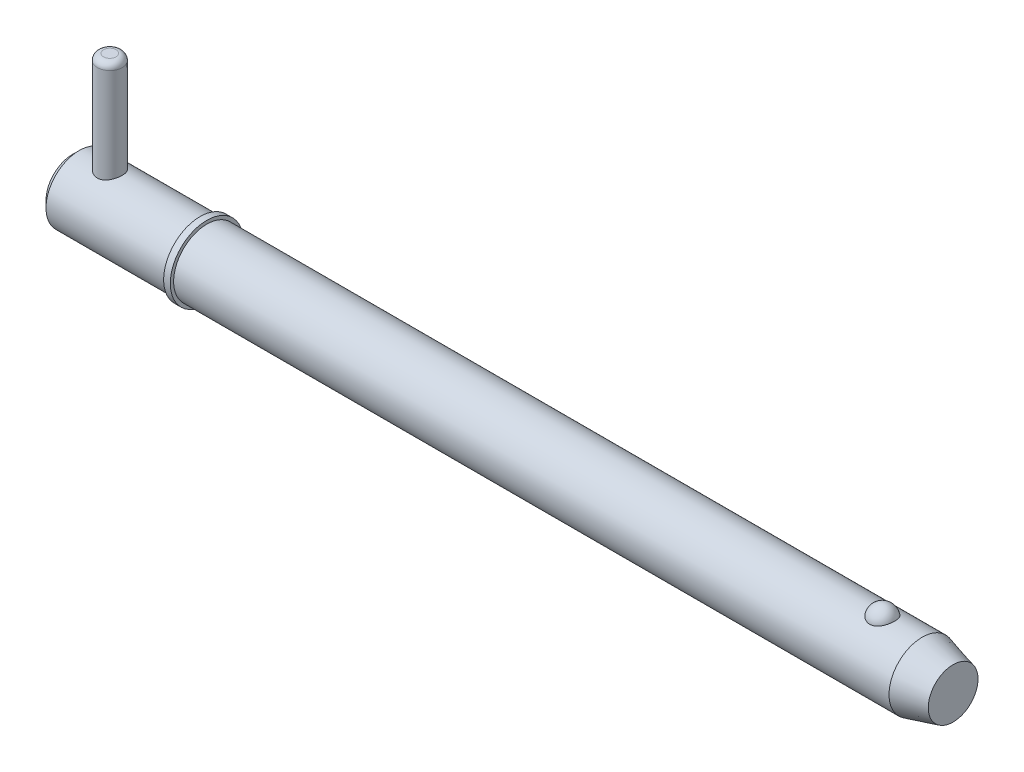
ISO-10303-21;
HEADER;
FILE_DESCRIPTION(('STEP AP214'),'2;1');
FILE_NAME('part.step','',(''),(''),'','','');
FILE_SCHEMA(('AUTOMOTIVE_DESIGN { 1 0 10303 214 1 1 1 1 }'));
ENDSEC;
DATA;
#1=APPLICATION_CONTEXT('core data for automotive mechanical design processes');
#2=APPLICATION_PROTOCOL_DEFINITION('international standard','automotive_design',2000,#1);
#3=PRODUCT_CONTEXT('',#1,'mechanical');
#4=PRODUCT('Part','Part','',(#3));
#5=PRODUCT_RELATED_PRODUCT_CATEGORY('part','',(#4));
#6=PRODUCT_DEFINITION_FORMATION('','',#4);
#7=PRODUCT_DEFINITION_CONTEXT('part definition',#1,'design');
#8=PRODUCT_DEFINITION('design','',#6,#7);
#9=PRODUCT_DEFINITION_SHAPE('','',#8);
#10=(LENGTH_UNIT() NAMED_UNIT(*) SI_UNIT(.MILLI.,.METRE.));
#11=(NAMED_UNIT(*) PLANE_ANGLE_UNIT() SI_UNIT($,.RADIAN.));
#12=(NAMED_UNIT(*) SI_UNIT($,.STERADIAN.) SOLID_ANGLE_UNIT());
#13=UNCERTAINTY_MEASURE_WITH_UNIT(LENGTH_MEASURE(1.E-05),#10,'distance_accuracy_value','');
#14=(GEOMETRIC_REPRESENTATION_CONTEXT(3) GLOBAL_UNCERTAINTY_ASSIGNED_CONTEXT((#13)) GLOBAL_UNIT_ASSIGNED_CONTEXT((#10,
#11,#12)) REPRESENTATION_CONTEXT('',''));
#15=CARTESIAN_POINT('',(0.,0.,0.));
#16=DIRECTION('',(0.,0.,1.));
#17=DIRECTION('',(1.,0.,0.));
#18=AXIS2_PLACEMENT_3D('',#15,#16,#17);
#19=CARTESIAN_POINT('',(7.14,25.4,0.));
#20=DIRECTION('',(0.,-1.,0.));
#21=DIRECTION('',(0.,0.,-1.));
#22=AXIS2_PLACEMENT_3D('',#19,#20,#21);
#23=CYLINDRICAL_SURFACE('',#22,2.38);
#24=CARTESIAN_POINT('',(7.14,-5.16,0.));
#25=DIRECTION('',(0.,1.,0.));
#26=DIRECTION('',(0.,0.,1.));
#27=AXIS2_PLACEMENT_3D('',#24,#25,#26);
#28=CIRCLE('',#27,2.38);
#29=CARTESIAN_POINT('',(7.14,-5.16,2.38));
#30=VERTEX_POINT('',#29);
#31=EDGE_CURVE('P0_E25',#30,#30,#28,.T.);
#32=ORIENTED_EDGE('',*,*,#31,.T.);
#33=EDGE_LOOP('',(#32));
#34=FACE_BOUND('',#33,.T.);
#35=CARTESIAN_POINT('',(7.14,24.21,0.));
#36=DIRECTION('',(0.,1.,0.));
#37=DIRECTION('',(0.,0.,1.));
#38=AXIS2_PLACEMENT_3D('',#35,#36,#37);
#39=CIRCLE('',#38,2.38);
#40=CARTESIAN_POINT('',(7.14,24.21,2.38));
#41=VERTEX_POINT('',#40);
#42=EDGE_CURVE('P0_E29',#41,#41,#39,.F.);
#43=ORIENTED_EDGE('',*,*,#42,.T.);
#44=EDGE_LOOP('',(#43));
#45=FACE_BOUND('',#44,.T.);
#46=ADVANCED_FACE('P0_F14',(#34,#45),#23,.T.);
#47=CARTESIAN_POINT('',(7.14,25.4,0.));
#48=DIRECTION('',(0.,1.,0.));
#49=DIRECTION('',(0.,0.,1.));
#50=AXIS2_PLACEMENT_3D('',#47,#48,#49);
#51=PLANE('',#50);
#52=CARTESIAN_POINT('',(7.14,25.4,0.));
#53=DIRECTION('',(0.,1.,0.));
#54=DIRECTION('',(0.,0.,1.));
#55=AXIS2_PLACEMENT_3D('',#52,#53,#54);
#56=CIRCLE('',#55,1.19);
#57=CARTESIAN_POINT('',(7.14,25.4,1.19));
#58=VERTEX_POINT('',#57);
#59=EDGE_CURVE('P0_E10',#58,#58,#56,.T.);
#60=ORIENTED_EDGE('',*,*,#59,.T.);
#61=EDGE_LOOP('',(#60));
#62=FACE_BOUND('',#61,.T.);
#63=ADVANCED_FACE('P0_F46',(#62),#51,.T.);
#64=CARTESIAN_POINT('',(7.14,-6.35,0.));
#65=DIRECTION('',(0.,1.,0.));
#66=DIRECTION('',(0.,0.,1.));
#67=AXIS2_PLACEMENT_3D('',#64,#65,#66);
#68=PLANE('',#67);
#69=CARTESIAN_POINT('',(7.14,-6.35,0.));
#70=DIRECTION('',(0.,1.,0.));
#71=DIRECTION('',(0.,0.,1.));
#72=AXIS2_PLACEMENT_3D('',#69,#70,#71);
#73=CIRCLE('',#72,1.19);
#74=CARTESIAN_POINT('',(7.14,-6.35,1.19));
#75=VERTEX_POINT('',#74);
#76=EDGE_CURVE('P0_E21',#75,#75,#73,.F.);
#77=ORIENTED_EDGE('',*,*,#76,.T.);
#78=EDGE_LOOP('',(#77));
#79=FACE_BOUND('',#78,.T.);
#80=ADVANCED_FACE('P0_F43',(#79),#68,.F.);
#81=CARTESIAN_POINT('',(7.14,-5.16,0.));
#82=DIRECTION('',(0.,1.,0.));
#83=DIRECTION('',(0.,0.,1.));
#84=AXIS2_PLACEMENT_3D('',#81,#82,#83);
#85=DEGENERATE_TOROIDAL_SURFACE('',#84,1.19,1.19,.T.);
#86=ORIENTED_EDGE('',*,*,#76,.F.);
#87=EDGE_LOOP('',(#86));
#88=FACE_BOUND('',#87,.T.);
#89=ORIENTED_EDGE('',*,*,#31,.F.);
#90=EDGE_LOOP('',(#89));
#91=FACE_BOUND('',#90,.T.);
#92=ADVANCED_FACE('P0_F38',(#88,#91),#85,.T.);
#93=CARTESIAN_POINT('',(7.14,24.21,0.));
#94=DIRECTION('',(0.,1.,0.));
#95=DIRECTION('',(0.,0.,1.));
#96=AXIS2_PLACEMENT_3D('',#93,#94,#95);
#97=DEGENERATE_TOROIDAL_SURFACE('',#96,1.19,1.19,.T.);
#98=ORIENTED_EDGE('',*,*,#42,.F.);
#99=EDGE_LOOP('',(#98));
#100=FACE_BOUND('',#99,.T.);
#101=ORIENTED_EDGE('',*,*,#59,.F.);
#102=EDGE_LOOP('',(#101));
#103=FACE_BOUND('',#102,.T.);
#104=ADVANCED_FACE('P0_F16',(#100,#103),#97,.T.);
#105=CLOSED_SHELL('',(#46,#63,#80,#92,#104));
#106=MANIFOLD_SOLID_BREP('P0_B1',#105);
#107=CARTESIAN_POINT('',(0.,0.,0.));
#108=DIRECTION('',(1.,0.,0.));
#109=DIRECTION('',(0.,0.,-1.));
#110=AXIS2_PLACEMENT_3D('',#107,#108,#109);
#111=CYLINDRICAL_SURFACE('',#110,6.35);
#112=CARTESIAN_POINT('',(162.655369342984,0.,0.));
#113=DIRECTION('',(1.,0.,0.));
#114=DIRECTION('',(0.,0.,-1.));
#115=AXIS2_PLACEMENT_3D('',#112,#113,#114);
#116=CIRCLE('',#115,6.35);
#117=CARTESIAN_POINT('',(162.655369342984,0.,-6.35));
#118=VERTEX_POINT('',#117);
#119=EDGE_CURVE('P1_E81',#118,#118,#116,.T.);
#120=ORIENTED_EDGE('',*,*,#119,.F.);
#121=EDGE_LOOP('',(#120));
#122=FACE_BOUND('',#121,.T.);
#123=CARTESIAN_POINT('',(25.7,0.,0.));
#124=DIRECTION('',(1.,0.,0.));
#125=DIRECTION('',(0.,0.,-1.));
#126=AXIS2_PLACEMENT_3D('',#123,#124,#125);
#127=CIRCLE('',#126,6.35);
#128=CARTESIAN_POINT('',(25.7,0.,-6.35));
#129=VERTEX_POINT('',#128);
#130=EDGE_CURVE('P1_E85',#129,#129,#127,.T.);
#131=ORIENTED_EDGE('',*,*,#130,.T.);
#132=EDGE_LOOP('',(#131));
#133=FACE_BOUND('',#132,.T.);
#134=CARTESIAN_POINT('',(155.030021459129,5.87502187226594,2.40969251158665));
#135=CARTESIAN_POINT('',(154.905030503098,5.87501645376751,2.40969773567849));
#136=CARTESIAN_POINT('',(154.780080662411,5.87916061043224,2.39967292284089));
#137=CARTESIAN_POINT('',(154.533909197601,5.89523112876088,2.35991730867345));
#138=CARTESIAN_POINT('',(154.412686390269,5.90715499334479,2.33019283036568));
#139=CARTESIAN_POINT('',(154.177517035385,5.93739567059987,2.25201402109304));
#140=CARTESIAN_POINT('',(154.063560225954,5.95570321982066,2.20358681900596));
#141=CARTESIAN_POINT('',(153.84557352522,5.99672067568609,2.08937987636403));
#142=CARTESIAN_POINT('',(153.741545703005,6.0194314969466,2.02359652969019));
#143=CARTESIAN_POINT('',(153.542943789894,6.06760647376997,1.87428969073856));
#144=CARTESIAN_POINT('',(153.448726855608,6.09313095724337,1.79031110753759));
#145=CARTESIAN_POINT('',(153.275255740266,6.14375873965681,1.6080017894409));
#146=CARTESIAN_POINT('',(153.196004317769,6.16886196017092,1.50966841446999));
#147=CARTESIAN_POINT('',(153.050845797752,6.21724600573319,1.29645884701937));
#148=CARTESIAN_POINT('',(152.985688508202,6.24039621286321,1.1810415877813));
#149=CARTESIAN_POINT('',(152.874703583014,6.28117277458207,0.940351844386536));
#150=CARTESIAN_POINT('',(152.828877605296,6.29879865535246,0.815078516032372));
#151=CARTESIAN_POINT('',(152.757023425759,6.32692073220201,0.556494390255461));
#152=CARTESIAN_POINT('',(152.731249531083,6.33732517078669,0.423102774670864));
#153=CARTESIAN_POINT('',(152.700988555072,6.34957673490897,0.153542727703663));
#154=CARTESIAN_POINT('',(152.696500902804,6.35142408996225,0.0173743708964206));
#155=CARTESIAN_POINT('',(152.708865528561,6.34638925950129,-0.253036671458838));
#156=CARTESIAN_POINT('',(152.725594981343,6.33955731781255,-0.387285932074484));
#157=CARTESIAN_POINT('',(152.779843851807,6.31794129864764,-0.650851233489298));
#158=CARTESIAN_POINT('',(152.817363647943,6.3031570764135,-0.780167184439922));
#159=CARTESIAN_POINT('',(152.912500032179,6.26711642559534,-1.03041949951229));
#160=CARTESIAN_POINT('',(152.970143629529,6.24585130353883,-1.15134433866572));
#161=CARTESIAN_POINT('',(153.104352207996,6.19905619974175,-1.38129800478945));
#162=CARTESIAN_POINT('',(153.180918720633,6.17352587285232,-1.49032586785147));
#163=CARTESIAN_POINT('',(153.351753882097,6.12080227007,-1.69393164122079));
#164=CARTESIAN_POINT('',(153.446100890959,6.09360200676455,-1.78844209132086));
#165=CARTESIAN_POINT('',(153.650119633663,6.04070434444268,-1.95970536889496));
#166=CARTESIAN_POINT('',(153.759790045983,6.015006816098,-2.0364597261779));
#167=CARTESIAN_POINT('',(153.989187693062,5.96867714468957,-2.16845644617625));
#168=CARTESIAN_POINT('',(154.108652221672,5.94794910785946,-2.22412062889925));
#169=CARTESIAN_POINT('',(154.356218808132,5.91340580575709,-2.31440992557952));
#170=CARTESIAN_POINT('',(154.484317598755,5.89958794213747,-2.34904294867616));
#171=CARTESIAN_POINT('',(154.738582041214,5.88111049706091,-2.39491590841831));
#172=CARTESIAN_POINT('',(154.864520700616,5.87602512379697,-2.40724512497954));
#173=CARTESIAN_POINT('',(155.116786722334,5.87428980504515,-2.41147867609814));
#174=CARTESIAN_POINT('',(155.243114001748,5.8776381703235,-2.40338710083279));
#175=CARTESIAN_POINT('',(155.488417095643,5.89212921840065,-2.36762715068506));
#176=CARTESIAN_POINT('',(155.607499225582,5.90302431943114,-2.3405803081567));
#177=CARTESIAN_POINT('',(155.83924472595,5.93113752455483,-2.26839066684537));
#178=CARTESIAN_POINT('',(155.951907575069,5.94835614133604,-2.22324640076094));
#179=CARTESIAN_POINT('',(156.170400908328,5.9877301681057,-2.11493806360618));
#180=CARTESIAN_POINT('',(156.276028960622,6.00998499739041,-2.05140269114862));
#181=CARTESIAN_POINT('',(156.475300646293,6.05690144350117,-1.90842705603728));
#182=CARTESIAN_POINT('',(156.568941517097,6.08156361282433,-1.82898313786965));
#183=CARTESIAN_POINT('',(156.746675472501,6.13211715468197,-1.65182429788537));
#184=CARTESIAN_POINT('',(156.830055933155,6.15800825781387,-1.5533938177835));
#185=CARTESIAN_POINT('',(156.979790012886,6.20712834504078,-1.34374214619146));
#186=CARTESIAN_POINT('',(157.046140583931,6.23035685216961,-1.23251867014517));
#187=CARTESIAN_POINT('',(157.162345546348,6.27251177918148,-0.996447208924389));
#188=CARTESIAN_POINT('',(157.211607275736,6.29127762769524,-0.871278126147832));
#189=CARTESIAN_POINT('',(157.289614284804,6.3215862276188,-0.613870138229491));
#190=CARTESIAN_POINT('',(157.318359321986,6.33312889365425,-0.481631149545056));
#191=CARTESIAN_POINT('',(157.354770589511,6.34782349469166,-0.213672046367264));
#192=CARTESIAN_POINT('',(157.362413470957,6.35096613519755,-0.0779482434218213));
#193=CARTESIAN_POINT('',(157.356395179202,6.34851322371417,0.192943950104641));
#194=CARTESIAN_POINT('',(157.342734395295,6.3429178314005,0.328112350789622));
#195=CARTESIAN_POINT('',(157.29450361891,6.32360512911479,0.593406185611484));
#196=CARTESIAN_POINT('',(157.260031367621,6.30992579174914,0.723552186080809));
#197=CARTESIAN_POINT('',(157.170953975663,6.27586325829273,0.97583417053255));
#198=CARTESIAN_POINT('',(157.11634761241,6.25547965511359,1.09796966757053));
#199=CARTESIAN_POINT('',(156.98775879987,6.20998183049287,1.33148921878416));
#200=CARTESIAN_POINT('',(156.913674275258,6.18484288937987,1.44281227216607));
#201=CARTESIAN_POINT('',(156.747820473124,6.13258735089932,1.65087683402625));
#202=CARTESIAN_POINT('',(156.656051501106,6.10547078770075,1.7476185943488));
#203=CARTESIAN_POINT('',(156.457183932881,6.05235879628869,1.92350926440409));
#204=CARTESIAN_POINT('',(156.350133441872,6.02636017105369,2.00271146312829));
#205=CARTESIAN_POINT('',(156.123138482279,5.97843747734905,2.14154159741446));
#206=CARTESIAN_POINT('',(156.003191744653,5.9565141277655,2.20116608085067));
#207=CARTESIAN_POINT('',(155.744523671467,5.91812106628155,2.30250570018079));
#208=CARTESIAN_POINT('',(155.60506980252,5.90217533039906,2.34256795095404));
#209=CARTESIAN_POINT('',(155.320397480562,5.88063128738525,2.3961521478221));
#210=CARTESIAN_POINT('',(155.17518174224,5.87502816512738,2.40968644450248));
#211=CARTESIAN_POINT('',(155.030021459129,5.87502187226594,2.40969251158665));
#212=B_SPLINE_CURVE_WITH_KNOTS('',3,(#134,#135,#136,#137,#138,#139,#140,#141,#142,#143,#144,
#145,#146,#147,#148,#149,#150,#151,#152,#153,#154,#155,#156,#157,#158,#159,#160,#161,#162,#163,
#164,#165,#166,#167,#168,#169,#170,#171,#172,#173,#174,#175,#176,#177,#178,#179,#180,#181,#182,
#183,#184,#185,#186,#187,#188,#189,#190,#191,#192,#193,#194,#195,#196,#197,#198,#199,#200,#201,
#202,#203,#204,#205,#206,#207,#208,#209,#210,#211),.UNSPECIFIED.,.T.,.F.,(4,2,2,2,2,2,2,2,2,2,2,
2,2,2,2,2,2,2,2,2,2,2,2,2,2,2,2,2,2,2,2,2,2,2,2,2,2,2,4),(0.,0.374440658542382,
0.748761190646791,1.122540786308,1.4963981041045,1.88098871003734,2.26565013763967,
2.66741104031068,3.06920639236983,3.47601794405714,3.88281858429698,4.28727498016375,
4.69173873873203,5.09674745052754,5.50178895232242,5.90865911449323,6.31549420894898,
6.71369855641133,7.11175305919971,7.48978077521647,7.86773278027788,8.23383886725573,
8.59997464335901,8.97409044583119,9.34829231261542,9.74122667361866,10.1342313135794,
10.5397522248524,10.9452779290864,11.3512521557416,11.75721896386,12.1612938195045,
12.5653932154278,12.9716540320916,13.3779078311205,13.7829098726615,14.1879832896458,
14.6230486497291,15.0579114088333),.UNSPECIFIED.);
#213=CARTESIAN_POINT('',(155.030021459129,5.87502187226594,2.40969251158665));
#214=VERTEX_POINT('',#213);
#215=EDGE_CURVE('P1_E35',#214,#214,#212,.T.);
#216=ORIENTED_EDGE('',*,*,#215,.T.);
#217=EDGE_LOOP('',(#216));
#218=FACE_BOUND('',#217,.T.);
#219=ADVANCED_FACE('P1_F13',(#122,#133,#218),#111,.T.);
#220=CARTESIAN_POINT('',(0.,0.,0.));
#221=DIRECTION('',(-1.,0.,0.));
#222=DIRECTION('',(0.,0.,1.));
#223=AXIS2_PLACEMENT_3D('',#220,#221,#222);
#224=PLANE('',#223);
#225=CARTESIAN_POINT('',(0.,0.,0.));
#226=DIRECTION('',(1.,0.,0.));
#227=DIRECTION('',(0.,0.,-1.));
#228=AXIS2_PLACEMENT_3D('',#225,#226,#227);
#229=CIRCLE('',#228,5.08);
#230=CARTESIAN_POINT('',(0.,0.,-5.08));
#231=VERTEX_POINT('',#230);
#232=EDGE_CURVE('P1_E9',#231,#231,#229,.T.);
#233=ORIENTED_EDGE('',*,*,#232,.F.);
#234=EDGE_LOOP('',(#233));
#235=FACE_BOUND('',#234,.T.);
#236=ADVANCED_FACE('P1_F15',(#235),#224,.T.);
#237=CARTESIAN_POINT('',(1.27,0.,0.));
#238=DIRECTION('',(1.,0.,0.));
#239=DIRECTION('',(0.,0.,-1.));
#240=AXIS2_PLACEMENT_3D('',#237,#238,#239);
#241=CONICAL_SURFACE('',#240,6.35,0.78539816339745);
#242=ORIENTED_EDGE('',*,*,#232,.T.);
#243=EDGE_LOOP('',(#242));
#244=FACE_BOUND('',#243,.T.);
#245=CARTESIAN_POINT('',(1.27,0.,0.));
#246=DIRECTION('',(1.,0.,0.));
#247=DIRECTION('',(0.,0.,-1.));
#248=AXIS2_PLACEMENT_3D('',#245,#246,#247);
#249=CIRCLE('',#248,6.35);
#250=CARTESIAN_POINT('',(1.27,0.,-6.35));
#251=VERTEX_POINT('',#250);
#252=EDGE_CURVE('P1_E26',#251,#251,#249,.T.);
#253=ORIENTED_EDGE('',*,*,#252,.F.);
#254=EDGE_LOOP('',(#253));
#255=FACE_BOUND('',#254,.T.);
#256=ADVANCED_FACE('P1_F77',(#244,#255),#241,.T.);
#257=CARTESIAN_POINT('',(0.,0.,0.));
#258=DIRECTION('',(1.,0.,0.));
#259=DIRECTION('',(0.,0.,-1.));
#260=AXIS2_PLACEMENT_3D('',#257,#258,#259);
#261=CYLINDRICAL_SURFACE('',#260,6.35);
#262=CARTESIAN_POINT('',(7.14,-5.88711304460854,2.38));
#263=CARTESIAN_POINT('',(7.01146258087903,-5.88710856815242,2.38000480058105));
#264=CARTESIAN_POINT('',(6.88295682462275,-5.89136840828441,2.36955244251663));
#265=CARTESIAN_POINT('',(6.62981934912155,-5.90782785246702,2.32820953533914));
#266=CARTESIAN_POINT('',(6.50518751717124,-5.92002722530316,2.29731958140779));
#267=CARTESIAN_POINT('',(6.26352403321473,-5.95079384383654,2.21639366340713));
#268=CARTESIAN_POINT('',(6.14647496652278,-5.96934583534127,2.16640353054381));
#269=CARTESIAN_POINT('',(5.92237941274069,-6.01070278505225,2.04885862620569));
#270=CARTESIAN_POINT('',(5.81533593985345,-6.03350901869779,1.98129858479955));
#271=CARTESIAN_POINT('',(5.60897525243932,-6.08207341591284,1.82693902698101));
#272=CARTESIAN_POINT('',(5.51022503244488,-6.10791836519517,1.73940861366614));
#273=CARTESIAN_POINT('',(5.32840561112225,-6.15892405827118,1.54914379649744));
#274=CARTESIAN_POINT('',(5.24533975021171,-6.1840846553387,1.44640616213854));
#275=CARTESIAN_POINT('',(5.09451639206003,-6.23191821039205,1.22434014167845));
#276=CARTESIAN_POINT('',(5.02737511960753,-6.25447755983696,1.10456656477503));
#277=CARTESIAN_POINT('',(4.91443001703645,-6.2935236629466,0.854429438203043));
#278=CARTESIAN_POINT('',(4.86861879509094,-6.31001251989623,0.724069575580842));
#279=CARTESIAN_POINT('',(4.80162253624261,-6.33444370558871,0.46242122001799));
#280=CARTESIAN_POINT('',(4.77946137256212,-6.34272370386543,0.331414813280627));
#281=CARTESIAN_POINT('',(4.75726677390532,-6.35101600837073,0.0672982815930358));
#282=CARTESIAN_POINT('',(4.75722615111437,-6.35103100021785,-0.0658111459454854));
#283=CARTESIAN_POINT('',(4.77870510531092,-6.3430064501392,-0.323358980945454));
#284=CARTESIAN_POINT('',(4.79915922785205,-6.33536494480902,-0.447900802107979));
#285=CARTESIAN_POINT('',(4.85925493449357,-6.31340794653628,-0.69163609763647));
#286=CARTESIAN_POINT('',(4.89889787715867,-6.29909198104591,-0.810829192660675));
#287=CARTESIAN_POINT('',(4.9967414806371,-6.26494471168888,-1.04254212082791));
#288=CARTESIAN_POINT('',(5.05520370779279,-6.24503620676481,-1.1549396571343));
#289=CARTESIAN_POINT('',(5.1887948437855,-6.20171869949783,-1.3686079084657));
#290=CARTESIAN_POINT('',(5.26392912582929,-6.17830856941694,-1.46987502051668));
#291=CARTESIAN_POINT('',(5.43386591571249,-6.12878580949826,-1.66468415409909));
#292=CARTESIAN_POINT('',(5.52956139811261,-6.10259519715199,-1.75742857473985));
#293=CARTESIAN_POINT('',(5.73530435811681,-6.05155777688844,-1.92585331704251));
#294=CARTESIAN_POINT('',(5.84535542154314,-6.02671130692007,-2.00152936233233));
#295=CARTESIAN_POINT('',(6.07982989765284,-5.98068420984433,-2.13519109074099));
#296=CARTESIAN_POINT('',(6.20451768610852,-5.95959698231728,-2.19274775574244));
#297=CARTESIAN_POINT('',(6.4628145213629,-5.92455622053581,-2.28574558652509));
#298=CARTESIAN_POINT('',(6.59641856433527,-5.91059872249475,-2.32119904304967));
#299=CARTESIAN_POINT('',(6.86087441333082,-5.8923327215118,-2.36717069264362));
#300=CARTESIAN_POINT('',(6.99147192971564,-5.8875347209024,-2.37895573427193));
#301=CARTESIAN_POINT('',(7.25283805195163,-5.88674545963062,-2.38091046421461));
#302=CARTESIAN_POINT('',(7.38360660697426,-5.89075200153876,-2.37108554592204));
#303=CARTESIAN_POINT('',(7.63510696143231,-5.90662331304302,-2.33124781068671));
#304=CARTESIAN_POINT('',(7.75602069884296,-5.91810660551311,-2.30221396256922));
#305=CARTESIAN_POINT('',(7.99120505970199,-5.94718527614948,-2.22601401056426));
#306=CARTESIAN_POINT('',(8.10547431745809,-5.96478190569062,-2.17884419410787));
#307=CARTESIAN_POINT('',(8.32888632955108,-6.00491533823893,-2.06572311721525));
#308=CARTESIAN_POINT('',(8.43767672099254,-6.02761250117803,-1.99913452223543));
#309=CARTESIAN_POINT('',(8.6429894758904,-6.07511988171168,-1.84974438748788));
#310=CARTESIAN_POINT('',(8.73950733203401,-6.09993087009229,-1.76693691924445));
#311=CARTESIAN_POINT('',(8.9238741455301,-6.1507686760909,-1.58125563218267));
#312=CARTESIAN_POINT('',(9.01078732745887,-6.17677301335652,-1.47744327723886));
#313=CARTESIAN_POINT('',(9.16607127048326,-6.22556172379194,-1.25606967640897));
#314=CARTESIAN_POINT('',(9.23444197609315,-6.24834608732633,-1.13850838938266));
#315=CARTESIAN_POINT('',(9.3502493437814,-6.28811144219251,-0.893050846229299));
#316=CARTESIAN_POINT('',(9.39775808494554,-6.30511236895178,-0.765192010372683));
#317=CARTESIAN_POINT('',(9.47032640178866,-6.33145833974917,-0.502514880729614));
#318=CARTESIAN_POINT('',(9.49539651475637,-6.34080697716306,-0.367699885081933));
#319=CARTESIAN_POINT('',(9.52124059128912,-6.35045496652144,-0.103396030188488));
#320=CARTESIAN_POINT('',(9.52334421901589,-6.35124952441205,0.025945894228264));
#321=CARTESIAN_POINT('',(9.50661518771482,-6.34499064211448,0.283061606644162));
#322=CARTESIAN_POINT('',(9.48778504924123,-6.33793814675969,0.410835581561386));
#323=CARTESIAN_POINT('',(9.43065630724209,-6.31700307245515,0.658028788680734));
#324=CARTESIAN_POINT('',(9.39284291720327,-6.30329098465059,0.7775756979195));
#325=CARTESIAN_POINT('',(9.29930406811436,-6.27046903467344,1.00863789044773));
#326=CARTESIAN_POINT('',(9.2435752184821,-6.25135815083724,1.12015164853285));
#327=CARTESIAN_POINT('',(9.11312349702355,-6.20865254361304,1.33711407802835));
#328=CARTESIAN_POINT('',(9.03770094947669,-6.18490316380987,1.44211105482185));
#329=CARTESIAN_POINT('',(8.87110640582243,-6.13583718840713,1.63836897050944));
#330=CARTESIAN_POINT('',(8.77992879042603,-6.11052003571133,1.72962498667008));
#331=CARTESIAN_POINT('',(8.57869799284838,-6.05953829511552,1.90076098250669));
#332=CARTESIAN_POINT('',(8.46790320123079,-6.03392573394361,1.97978778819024));
#333=CARTESIAN_POINT('',(8.23379693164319,-5.98676607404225,2.11813466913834));
#334=CARTESIAN_POINT('',(8.11048418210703,-5.9652193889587,2.17745273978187));
#335=CARTESIAN_POINT('',(7.84900037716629,-5.92818393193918,2.27641807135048));
#336=CARTESIAN_POINT('',(7.71041678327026,-5.91299857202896,2.31510015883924));
#337=CARTESIAN_POINT('',(7.42787316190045,-5.89246887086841,2.36688002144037));
#338=CARTESIAN_POINT('',(7.28391673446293,-5.88711805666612,2.37999462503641));
#339=CARTESIAN_POINT('',(7.14,-5.88711304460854,2.38));
#340=B_SPLINE_CURVE_WITH_KNOTS('',3,(#262,#263,#264,#265,#266,#267,#268,#269,#270,#271,#272,
#273,#274,#275,#276,#277,#278,#279,#280,#281,#282,#283,#284,#285,#286,#287,#288,#289,#290,#291,
#292,#293,#294,#295,#296,#297,#298,#299,#300,#301,#302,#303,#304,#305,#306,#307,#308,#309,#310,
#311,#312,#313,#314,#315,#316,#317,#318,#319,#320,#321,#322,#323,#324,#325,#326,#327,#328,#329,
#330,#331,#332,#333,#334,#335,#336,#337,#338,#339),.UNSPECIFIED.,.T.,.F.,(4,2,2,2,2,2,2,2,2,2,2,
2,2,2,2,2,2,2,2,2,2,2,2,2,2,2,2,2,2,2,2,2,2,2,2,2,2,2,4),(0.,0.385076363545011,
0.770141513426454,1.15428843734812,1.53855071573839,1.94016118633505,2.3418570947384,
2.75720522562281,3.1724093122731,3.569721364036,3.96690431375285,4.34445758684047,
4.72203759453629,5.10511017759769,5.48830640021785,5.89390240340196,6.29959991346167,
6.71428455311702,7.12873839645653,7.52034494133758,7.91185376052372,8.28480528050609,
8.65783318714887,9.0448340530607,9.43197664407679,9.84363087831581,10.2552863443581,
10.6655081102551,11.0755371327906,11.4616919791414,11.847800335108,12.224507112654,
12.6012852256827,12.9938941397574,13.386643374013,13.8000944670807,14.2135876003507,
14.6450218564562,15.0761720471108),.UNSPECIFIED.);
#341=CARTESIAN_POINT('',(7.14,-5.88711304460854,2.38));
#342=VERTEX_POINT('',#341);
#343=EDGE_CURVE('P1_E17',#342,#342,#340,.T.);
#344=ORIENTED_EDGE('',*,*,#343,.F.);
#345=EDGE_LOOP('',(#344));
#346=FACE_BOUND('',#345,.T.);
#347=CARTESIAN_POINT('',(7.14,5.88711304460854,2.38));
#348=CARTESIAN_POINT('',(7.26853741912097,5.88710856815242,2.38000480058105));
#349=CARTESIAN_POINT('',(7.39704317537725,5.89136840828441,2.36955244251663));
#350=CARTESIAN_POINT('',(7.65018065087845,5.90782785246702,2.32820953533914));
#351=CARTESIAN_POINT('',(7.77481248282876,5.92002722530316,2.29731958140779));
#352=CARTESIAN_POINT('',(8.01647596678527,5.95079384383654,2.21639366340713));
#353=CARTESIAN_POINT('',(8.13352503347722,5.96934583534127,2.16640353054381));
#354=CARTESIAN_POINT('',(8.35762058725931,6.01070278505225,2.04885862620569));
#355=CARTESIAN_POINT('',(8.46466406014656,6.03350901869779,1.98129858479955));
#356=CARTESIAN_POINT('',(8.67102474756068,6.08207341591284,1.82693902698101));
#357=CARTESIAN_POINT('',(8.76977496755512,6.10791836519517,1.73940861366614));
#358=CARTESIAN_POINT('',(8.95159438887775,6.15892405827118,1.54914379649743));
#359=CARTESIAN_POINT('',(9.03466024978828,6.1840846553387,1.44640616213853));
#360=CARTESIAN_POINT('',(9.18548360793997,6.23191821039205,1.22434014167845));
#361=CARTESIAN_POINT('',(9.25262488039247,6.25447755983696,1.10456656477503));
#362=CARTESIAN_POINT('',(9.36556998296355,6.2935236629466,0.854429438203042));
#363=CARTESIAN_POINT('',(9.41138120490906,6.31001251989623,0.72406957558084));
#364=CARTESIAN_POINT('',(9.47837746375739,6.33444370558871,0.462421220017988));
#365=CARTESIAN_POINT('',(9.50053862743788,6.34272370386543,0.331414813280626));
#366=CARTESIAN_POINT('',(9.52273322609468,6.35101600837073,0.0672982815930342));
#367=CARTESIAN_POINT('',(9.52277384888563,6.35103100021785,-0.0658111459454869));
#368=CARTESIAN_POINT('',(9.50129489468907,6.3430064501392,-0.323358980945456));
#369=CARTESIAN_POINT('',(9.48084077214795,6.33536494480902,-0.447900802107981));
#370=CARTESIAN_POINT('',(9.42074506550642,6.31340794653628,-0.691636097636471));
#371=CARTESIAN_POINT('',(9.38110212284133,6.29909198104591,-0.810829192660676));
#372=CARTESIAN_POINT('',(9.2832585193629,6.26494471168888,-1.04254212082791));
#373=CARTESIAN_POINT('',(9.22479629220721,6.24503620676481,-1.1549396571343));
#374=CARTESIAN_POINT('',(9.0912051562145,6.20171869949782,-1.3686079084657));
#375=CARTESIAN_POINT('',(9.0160708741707,6.17830856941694,-1.46987502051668));
#376=CARTESIAN_POINT('',(8.84613408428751,6.12878580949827,-1.66468415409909));
#377=CARTESIAN_POINT('',(8.75043860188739,6.10259519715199,-1.75742857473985));
#378=CARTESIAN_POINT('',(8.54469564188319,6.05155777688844,-1.92585331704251));
#379=CARTESIAN_POINT('',(8.43464457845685,6.02671130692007,-2.00152936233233));
#380=CARTESIAN_POINT('',(8.20017010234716,5.98068420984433,-2.13519109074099));
#381=CARTESIAN_POINT('',(8.07548231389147,5.95959698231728,-2.19274775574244));
#382=CARTESIAN_POINT('',(7.8171854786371,5.9245562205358,-2.28574558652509));
#383=CARTESIAN_POINT('',(7.68358143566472,5.91059872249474,-2.32119904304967));
#384=CARTESIAN_POINT('',(7.41912558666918,5.8923327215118,-2.36717069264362));
#385=CARTESIAN_POINT('',(7.28852807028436,5.8875347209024,-2.37895573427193));
#386=CARTESIAN_POINT('',(7.02716194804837,5.88674545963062,-2.38091046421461));
#387=CARTESIAN_POINT('',(6.89639339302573,5.89075200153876,-2.37108554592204));
#388=CARTESIAN_POINT('',(6.64489303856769,5.90662331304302,-2.33124781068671));
#389=CARTESIAN_POINT('',(6.52397930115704,5.91810660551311,-2.30221396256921));
#390=CARTESIAN_POINT('',(6.288794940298,5.94718527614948,-2.22601401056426));
#391=CARTESIAN_POINT('',(6.17452568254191,5.96478190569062,-2.17884419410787));
#392=CARTESIAN_POINT('',(5.95111367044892,6.00491533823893,-2.06572311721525));
#393=CARTESIAN_POINT('',(5.84232327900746,6.02761250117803,-1.99913452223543));
#394=CARTESIAN_POINT('',(5.6370105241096,6.07511988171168,-1.84974438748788));
#395=CARTESIAN_POINT('',(5.54049266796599,6.09993087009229,-1.76693691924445));
#396=CARTESIAN_POINT('',(5.3561258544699,6.1507686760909,-1.58125563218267));
#397=CARTESIAN_POINT('',(5.26921267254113,6.17677301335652,-1.47744327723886));
#398=CARTESIAN_POINT('',(5.11392872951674,6.22556172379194,-1.25606967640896));
#399=CARTESIAN_POINT('',(5.04555802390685,6.24834608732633,-1.13850838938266));
#400=CARTESIAN_POINT('',(4.9297506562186,6.28811144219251,-0.893050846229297));
#401=CARTESIAN_POINT('',(4.88224191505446,6.30511236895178,-0.76519201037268));
#402=CARTESIAN_POINT('',(4.80967359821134,6.33145833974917,-0.502514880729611));
#403=CARTESIAN_POINT('',(4.78460348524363,6.34080697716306,-0.36769988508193));
#404=CARTESIAN_POINT('',(4.75875940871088,6.35045496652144,-0.103396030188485));
#405=CARTESIAN_POINT('',(4.75665578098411,6.35124952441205,0.025945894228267));
#406=CARTESIAN_POINT('',(4.77338481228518,6.34499064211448,0.283061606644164));
#407=CARTESIAN_POINT('',(4.79221495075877,6.33793814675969,0.410835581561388));
#408=CARTESIAN_POINT('',(4.84934369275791,6.31700307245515,0.658028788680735));
#409=CARTESIAN_POINT('',(4.88715708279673,6.30329098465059,0.777575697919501));
#410=CARTESIAN_POINT('',(4.98069593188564,6.27046903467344,1.00863789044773));
#411=CARTESIAN_POINT('',(5.0364247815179,6.25135815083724,1.12015164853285));
#412=CARTESIAN_POINT('',(5.16687650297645,6.20865254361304,1.33711407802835));
#413=CARTESIAN_POINT('',(5.24229905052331,6.18490316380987,1.44211105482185));
#414=CARTESIAN_POINT('',(5.40889359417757,6.13583718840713,1.63836897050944));
#415=CARTESIAN_POINT('',(5.50007120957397,6.11052003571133,1.72962498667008));
#416=CARTESIAN_POINT('',(5.70130200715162,6.05953829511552,1.90076098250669));
#417=CARTESIAN_POINT('',(5.81209679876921,6.03392573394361,1.97978778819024));
#418=CARTESIAN_POINT('',(6.04620306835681,5.98676607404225,2.11813466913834));
#419=CARTESIAN_POINT('',(6.16951581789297,5.9652193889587,2.17745273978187));
#420=CARTESIAN_POINT('',(6.43099962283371,5.92818393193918,2.27641807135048));
#421=CARTESIAN_POINT('',(6.56958321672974,5.91299857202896,2.31510015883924));
#422=CARTESIAN_POINT('',(6.85212683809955,5.89246887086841,2.36688002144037));
#423=CARTESIAN_POINT('',(6.99608326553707,5.88711805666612,2.37999462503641));
#424=CARTESIAN_POINT('',(7.14,5.88711304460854,2.38));
#425=B_SPLINE_CURVE_WITH_KNOTS('',3,(#347,#348,#349,#350,#351,#352,#353,#354,#355,#356,#357,
#358,#359,#360,#361,#362,#363,#364,#365,#366,#367,#368,#369,#370,#371,#372,#373,#374,#375,#376,
#377,#378,#379,#380,#381,#382,#383,#384,#385,#386,#387,#388,#389,#390,#391,#392,#393,#394,#395,
#396,#397,#398,#399,#400,#401,#402,#403,#404,#405,#406,#407,#408,#409,#410,#411,#412,#413,#414,
#415,#416,#417,#418,#419,#420,#421,#422,#423,#424),.UNSPECIFIED.,.T.,.F.,(4,2,2,2,2,2,2,2,2,2,2,
2,2,2,2,2,2,2,2,2,2,2,2,2,2,2,2,2,2,2,2,2,2,2,2,2,2,2,4),(0.,0.385076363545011,
0.770141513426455,1.15428843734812,1.53855071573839,1.94016118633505,2.3418570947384,
2.75720522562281,3.1724093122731,3.56972136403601,3.96690431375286,4.34445758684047,
4.72203759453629,5.10511017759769,5.48830640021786,5.89390240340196,6.29959991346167,
6.71428455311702,7.12873839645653,7.52034494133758,7.91185376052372,8.2848052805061,
8.65783318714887,9.0448340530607,9.43197664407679,9.84363087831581,10.2552863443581,
10.6655081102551,11.0755371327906,11.4616919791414,11.847800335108,12.2245071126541,
12.6012852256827,12.9938941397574,13.386643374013,13.8000944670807,14.2135876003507,
14.6450218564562,15.0761720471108),.UNSPECIFIED.);
#426=CARTESIAN_POINT('',(7.14,5.88711304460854,2.38));
#427=VERTEX_POINT('',#426);
#428=EDGE_CURVE('P1_E43',#427,#427,#425,.T.);
#429=ORIENTED_EDGE('',*,*,#428,.F.);
#430=EDGE_LOOP('',(#429));
#431=FACE_BOUND('',#430,.T.);
#432=ORIENTED_EDGE('',*,*,#252,.T.);
#433=EDGE_LOOP('',(#432));
#434=FACE_BOUND('',#433,.T.);
#435=CARTESIAN_POINT('',(24.43,0.,0.));
#436=DIRECTION('',(1.,0.,0.));
#437=DIRECTION('',(0.,0.,-1.));
#438=AXIS2_PLACEMENT_3D('',#435,#436,#437);
#439=CIRCLE('',#438,6.35);
#440=CARTESIAN_POINT('',(24.43,0.,-6.35));
#441=VERTEX_POINT('',#440);
#442=EDGE_CURVE('P1_E31',#441,#441,#439,.T.);
#443=ORIENTED_EDGE('',*,*,#442,.F.);
#444=EDGE_LOOP('',(#443));
#445=FACE_BOUND('',#444,.T.);
#446=ADVANCED_FACE('P1_F103',(#346,#431,#434,#445),#261,.T.);
#447=CARTESIAN_POINT('',(24.43,6.35,0.));
#448=DIRECTION('',(-1.,0.,0.));
#449=DIRECTION('',(0.,0.,1.));
#450=AXIS2_PLACEMENT_3D('',#447,#448,#449);
#451=PLANE('',#450);
#452=ORIENTED_EDGE('',*,*,#442,.T.);
#453=EDGE_LOOP('',(#452));
#454=FACE_BOUND('',#453,.T.);
#455=CARTESIAN_POINT('',(24.43,0.,0.));
#456=DIRECTION('',(1.,0.,0.));
#457=DIRECTION('',(0.,0.,-1.));
#458=AXIS2_PLACEMENT_3D('',#455,#456,#457);
#459=CIRCLE('',#458,6.985);
#460=CARTESIAN_POINT('',(24.43,0.,-6.985));
#461=VERTEX_POINT('',#460);
#462=EDGE_CURVE('P1_E91',#461,#461,#459,.T.);
#463=ORIENTED_EDGE('',*,*,#462,.F.);
#464=EDGE_LOOP('',(#463));
#465=FACE_BOUND('',#464,.T.);
#466=ADVANCED_FACE('P1_F100',(#454,#465),#451,.T.);
#467=CARTESIAN_POINT('',(0.,0.,0.));
#468=DIRECTION('',(1.,0.,0.));
#469=DIRECTION('',(0.,0.,-1.));
#470=AXIS2_PLACEMENT_3D('',#467,#468,#469);
#471=CYLINDRICAL_SURFACE('',#470,6.985);
#472=ORIENTED_EDGE('',*,*,#462,.T.);
#473=EDGE_LOOP('',(#472));
#474=FACE_BOUND('',#473,.T.);
#475=CARTESIAN_POINT('',(25.7,0.,0.));
#476=DIRECTION('',(1.,0.,0.));
#477=DIRECTION('',(0.,0.,-1.));
#478=AXIS2_PLACEMENT_3D('',#475,#476,#477);
#479=CIRCLE('',#478,6.985);
#480=CARTESIAN_POINT('',(25.7,0.,-6.985));
#481=VERTEX_POINT('',#480);
#482=EDGE_CURVE('P1_E88',#481,#481,#479,.T.);
#483=ORIENTED_EDGE('',*,*,#482,.F.);
#484=EDGE_LOOP('',(#483));
#485=FACE_BOUND('',#484,.T.);
#486=ADVANCED_FACE('P1_F68',(#474,#485),#471,.T.);
#487=CARTESIAN_POINT('',(25.7,6.985,0.));
#488=DIRECTION('',(1.,0.,0.));
#489=DIRECTION('',(0.,0.,-1.));
#490=AXIS2_PLACEMENT_3D('',#487,#488,#489);
#491=PLANE('',#490);
#492=ORIENTED_EDGE('',*,*,#482,.T.);
#493=EDGE_LOOP('',(#492));
#494=FACE_BOUND('',#493,.T.);
#495=ORIENTED_EDGE('',*,*,#130,.F.);
#496=EDGE_LOOP('',(#495));
#497=FACE_BOUND('',#496,.T.);
#498=ADVANCED_FACE('P1_F62',(#494,#497),#491,.T.);
#499=CARTESIAN_POINT('',(168.58,0.,0.));
#500=DIRECTION('',(-1.,0.,0.));
#501=DIRECTION('',(0.,0.,1.));
#502=AXIS2_PLACEMENT_3D('',#499,#500,#501);
#503=CONICAL_SURFACE('',#502,4.76250000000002,0.26179938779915);
#504=ORIENTED_EDGE('',*,*,#119,.T.);
#505=EDGE_LOOP('',(#504));
#506=FACE_BOUND('',#505,.T.);
#507=CARTESIAN_POINT('',(168.58,0.,0.));
#508=DIRECTION('',(1.,0.,0.));
#509=DIRECTION('',(0.,0.,-1.));
#510=AXIS2_PLACEMENT_3D('',#507,#508,#509);
#511=CIRCLE('',#510,4.76250000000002);
#512=CARTESIAN_POINT('',(168.58,0.,-4.76250000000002));
#513=VERTEX_POINT('',#512);
#514=EDGE_CURVE('P1_E42',#513,#513,#511,.T.);
#515=ORIENTED_EDGE('',*,*,#514,.F.);
#516=EDGE_LOOP('',(#515));
#517=FACE_BOUND('',#516,.T.);
#518=ADVANCED_FACE('P1_F59',(#506,#517),#503,.T.);
#519=CARTESIAN_POINT('',(168.58,4.76250000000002,0.));
#520=DIRECTION('',(1.,0.,0.));
#521=DIRECTION('',(0.,0.,-1.));
#522=AXIS2_PLACEMENT_3D('',#519,#520,#521);
#523=PLANE('',#522);
#524=ORIENTED_EDGE('',*,*,#514,.T.);
#525=EDGE_LOOP('',(#524));
#526=FACE_BOUND('',#525,.T.);
#527=ADVANCED_FACE('P1_F55',(#526),#523,.T.);
#528=CARTESIAN_POINT('',(155.030021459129,5.715,0.));
#529=DIRECTION('',(-1.,0.,0.));
#530=DIRECTION('',(0.,1.,0.));
#531=AXIS2_PLACEMENT_3D('',#528,#529,#530);
#532=SPHERICAL_SURFACE('',#531,2.41500000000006);
#533=ORIENTED_EDGE('',*,*,#215,.F.);
#534=EDGE_LOOP('',(#533));
#535=FACE_BOUND('',#534,.T.);
#536=ADVANCED_FACE('P1_F50',(#535),#532,.T.);
#537=CARTESIAN_POINT('',(7.14,-6.985,0.));
#538=DIRECTION('',(0.,1.,0.));
#539=DIRECTION('',(0.,0.,1.));
#540=AXIS2_PLACEMENT_3D('',#537,#538,#539);
#541=CYLINDRICAL_SURFACE('',#540,2.38);
#542=ORIENTED_EDGE('',*,*,#343,.T.);
#543=EDGE_LOOP('',(#542));
#544=FACE_BOUND('',#543,.T.);
#545=ORIENTED_EDGE('',*,*,#428,.T.);
#546=EDGE_LOOP('',(#545));
#547=FACE_BOUND('',#546,.T.);
#548=ADVANCED_FACE('P1_F54',(#544,#547),#541,.F.);
#549=CLOSED_SHELL('',(#219,#236,#256,#446,#466,#486,#498,#518,#527,#536,#548));
#550=MANIFOLD_SOLID_BREP('P1_B1',#549);
#551=ADVANCED_BREP_SHAPE_REPRESENTATION('',(#18,#106,#550),#14);
#552=SHAPE_DEFINITION_REPRESENTATION(#9,#551);
ENDSEC;
END-ISO-10303-21;
